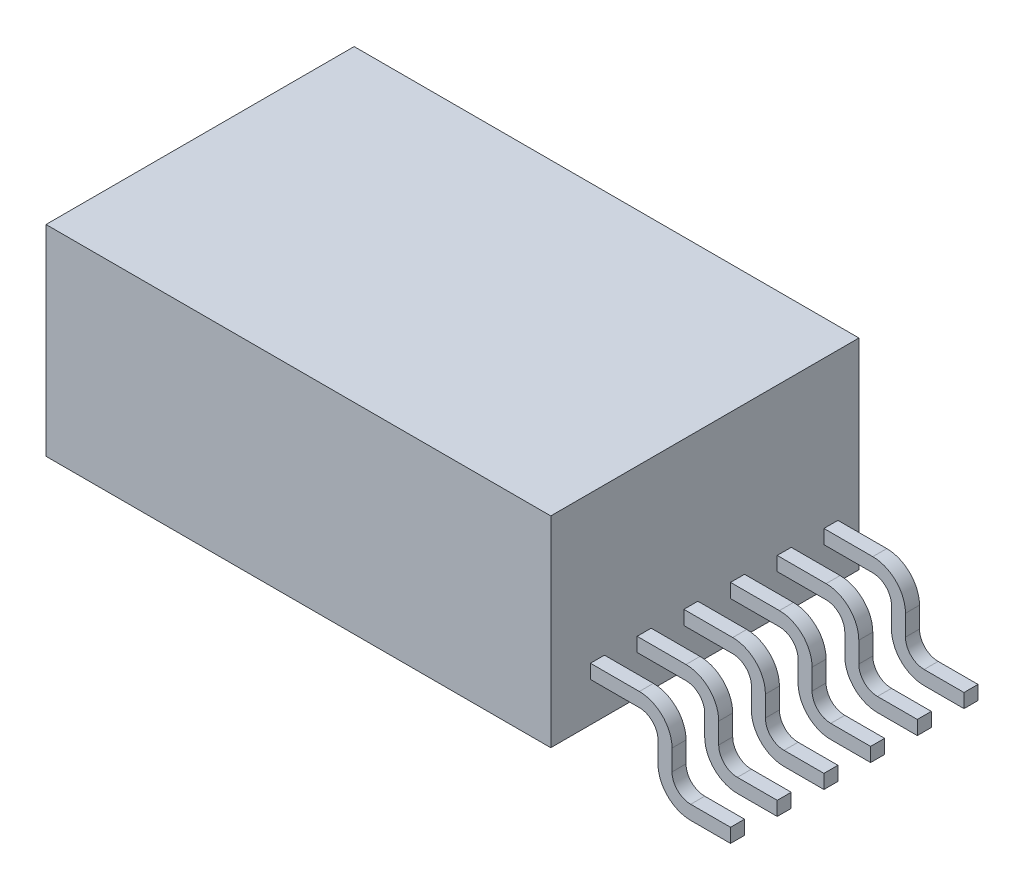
from build123d import *

# Parameters (mm, degrees)
LINEAR_AUSTRAGEN1_DEPTH      = 0.75
LINEAR_AUSTRAGEN2_DEPTH      = 30
LINEAR_AUSTRAGEN2_DEPTH_BACK = 3
SKIZZE2_W                    = 54.05249893
SKIZZE2_H                    = 21.5
LINEARES_MUSTER1_COUNT       = 6
LINEARES_MUSTER1_PITCH       = 5


with BuildPart() as part:
    # Skizze1 → Linear austragen1 (new, symmetric)
    with BuildSketch(Plane.XY):
        with BuildLine():
            Line((0, 0), (5.233225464, 0))
            ThreePointArc((5.233225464, 0), (6.647439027, -0.585786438), (7.233225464, -2))
            Line((7.233225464, -2), (7.233225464, -4.211073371))
            ThreePointArc((7.233225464, -4.211073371), (8.25835173, -6.685947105), (10.733225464, -7.711073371))
            Line((10.733225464, -7.711073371), (15, -7.711073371))
            Line((15, -7.711073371), (15, -6.211073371))
            Line((15, -6.211073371), (10.733225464, -6.211073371))
            ThreePointArc((10.733225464, -6.211073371), (9.319011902, -5.625286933), (8.733225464, -4.211073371))
            Line((8.733225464, -4.211073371), (8.733225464, -2))
            ThreePointArc((8.733225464, -2), (7.708099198, 0.474873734), (5.233225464, 1.5))
            Line((5.233225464, 1.5), (0, 1.5))
            Line((0, 1.5), (0, 0))
        make_face()
    linear_austragen1 = extrude(amount=LINEAR_AUSTRAGEN1_DEPTH, both=True)

    # Skizze2 → Linear austragen2 (add, two sides: drawn at the far end of the back side and taken through both)
    with BuildSketch(Plane.XY.offset(-LINEAR_AUSTRAGEN2_DEPTH_BACK)):
        with Locations((-27.026249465, 6.538926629)):
            Rectangle(SKIZZE2_W, SKIZZE2_H)
    extrude(amount=LINEAR_AUSTRAGEN2_DEPTH + LINEAR_AUSTRAGEN2_DEPTH_BACK)

    # Lineares Muster1: Linear austragen1 ×6
    with Locations(*[(0, 0, i * LINEARES_MUSTER1_PITCH) for i in range(1, LINEARES_MUSTER1_COUNT)]):
        add(linear_austragen1)


solid = part.part
